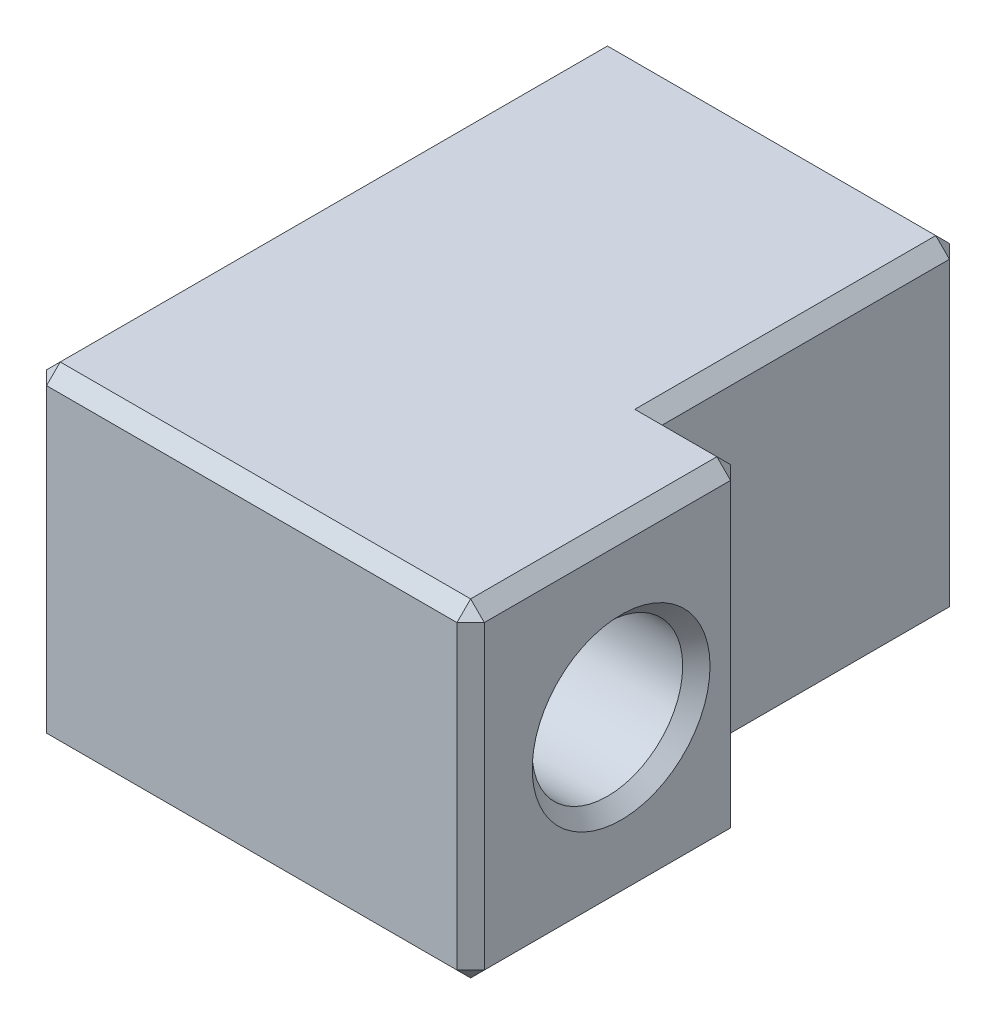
ISO-10303-21;
HEADER;
FILE_DESCRIPTION(('STEP AP214'),'2;1');
FILE_NAME('part.step','',(''),(''),'','','');
FILE_SCHEMA(('AUTOMOTIVE_DESIGN { 1 0 10303 214 1 1 1 1 }'));
ENDSEC;
DATA;
#1=APPLICATION_CONTEXT('core data for automotive mechanical design processes');
#2=APPLICATION_PROTOCOL_DEFINITION('international standard','automotive_design',2000,#1);
#3=PRODUCT_CONTEXT('',#1,'mechanical');
#4=PRODUCT('Part','Part','',(#3));
#5=PRODUCT_RELATED_PRODUCT_CATEGORY('part','',(#4));
#6=PRODUCT_DEFINITION_FORMATION('','',#4);
#7=PRODUCT_DEFINITION_CONTEXT('part definition',#1,'design');
#8=PRODUCT_DEFINITION('design','',#6,#7);
#9=PRODUCT_DEFINITION_SHAPE('','',#8);
#10=(LENGTH_UNIT() NAMED_UNIT(*) SI_UNIT(.MILLI.,.METRE.));
#11=(NAMED_UNIT(*) PLANE_ANGLE_UNIT() SI_UNIT($,.RADIAN.));
#12=(NAMED_UNIT(*) SI_UNIT($,.STERADIAN.) SOLID_ANGLE_UNIT());
#13=UNCERTAINTY_MEASURE_WITH_UNIT(LENGTH_MEASURE(1.E-05),#10,'distance_accuracy_value','');
#14=(GEOMETRIC_REPRESENTATION_CONTEXT(3) GLOBAL_UNCERTAINTY_ASSIGNED_CONTEXT((#13)) GLOBAL_UNIT_ASSIGNED_CONTEXT((#10,
#11,#12)) REPRESENTATION_CONTEXT('',''));
#15=CARTESIAN_POINT('',(0.,0.,0.));
#16=DIRECTION('',(0.,0.,1.));
#17=DIRECTION('',(1.,0.,0.));
#18=AXIS2_PLACEMENT_3D('',#15,#16,#17);
#19=CARTESIAN_POINT('',(-33.,40.,-21.));
#20=DIRECTION('',(1.,0.,0.));
#21=DIRECTION('',(0.,0.,-1.));
#22=AXIS2_PLACEMENT_3D('',#19,#20,#21);
#23=PLANE('',#22);
#24=CARTESIAN_POINT('',(-33.,34.,-5.5));
#25=DIRECTION('',(1.,0.,0.));
#26=DIRECTION('',(0.,0.,-1.));
#27=AXIS2_PLACEMENT_3D('',#24,#25,#26);
#28=CIRCLE('',#27,3.25);
#29=CARTESIAN_POINT('',(-33.,34.,-8.75));
#30=VERTEX_POINT('',#29);
#31=EDGE_CURVE('E189',#30,#30,#28,.F.);
#32=ORIENTED_EDGE('',*,*,#31,.T.);
#33=EDGE_LOOP('',(#32));
#34=FACE_BOUND('',#33,.T.);
#35=DIRECTION('',(0.,1.,0.));
#36=VECTOR('',#35,1.);
#37=CARTESIAN_POINT('',(-33.,40.,-9.5));
#38=LINE('',#37,#36);
#39=CARTESIAN_POINT('',(-33.,28.5,-9.5));
#40=VERTEX_POINT('',#39);
#41=CARTESIAN_POINT('',(-33.,39.5,-9.5));
#42=VERTEX_POINT('',#41);
#43=EDGE_CURVE('E154',#40,#42,#38,.T.);
#44=ORIENTED_EDGE('',*,*,#43,.T.);
#45=DIRECTION('',(0.,0.,1.));
#46=VECTOR('',#45,1.);
#47=CARTESIAN_POINT('',(-33.,39.5,-21.));
#48=LINE('',#47,#46);
#49=CARTESIAN_POINT('',(-33.,39.5,-0.5));
#50=VERTEX_POINT('',#49);
#51=EDGE_CURVE('E150',#42,#50,#48,.T.);
#52=ORIENTED_EDGE('',*,*,#51,.T.);
#53=DIRECTION('',(0.,-1.,0.));
#54=VECTOR('',#53,1.);
#55=CARTESIAN_POINT('',(-33.,28.,-0.5));
#56=LINE('',#55,#54);
#57=CARTESIAN_POINT('',(-33.,28.5,-0.5));
#58=VERTEX_POINT('',#57);
#59=EDGE_CURVE('E143',#50,#58,#56,.T.);
#60=ORIENTED_EDGE('',*,*,#59,.T.);
#61=DIRECTION('',(0.,0.,-1.));
#62=VECTOR('',#61,1.);
#63=CARTESIAN_POINT('',(-33.,28.5,-21.));
#64=LINE('',#63,#62);
#65=EDGE_CURVE('E147',#58,#40,#64,.T.);
#66=ORIENTED_EDGE('',*,*,#65,.T.);
#67=EDGE_LOOP('',(#44,#52,#60,#66));
#68=FACE_BOUND('',#67,.T.);
#69=ADVANCED_FACE('F16',(#34,#68),#23,.T.);
#70=CARTESIAN_POINT('',(-33.,28.,-21.));
#71=DIRECTION('',(0.,-1.,0.));
#72=DIRECTION('',(1.,0.,0.));
#73=AXIS2_PLACEMENT_3D('',#70,#71,#72);
#74=PLANE('',#73);
#75=DIRECTION('',(1.,0.,0.));
#76=VECTOR('',#75,1.);
#77=CARTESIAN_POINT('',(-33.,28.,-20.5));
#78=LINE('',#77,#76);
#79=CARTESIAN_POINT('',(-48.5,28.,-20.5));
#80=VERTEX_POINT('',#79);
#81=CARTESIAN_POINT('',(-36.5,28.,-20.5));
#82=VERTEX_POINT('',#81);
#83=EDGE_CURVE('E541',#80,#82,#78,.T.);
#84=ORIENTED_EDGE('',*,*,#83,.T.);
#85=DIRECTION('',(0.,0.,1.));
#86=VECTOR('',#85,1.);
#87=CARTESIAN_POINT('',(-36.5,28.,-10.));
#88=LINE('',#87,#86);
#89=CARTESIAN_POINT('',(-36.5,28.,-9.5));
#90=VERTEX_POINT('',#89);
#91=EDGE_CURVE('E485',#82,#90,#88,.T.);
#92=ORIENTED_EDGE('',*,*,#91,.T.);
#93=DIRECTION('',(1.,0.,0.));
#94=VECTOR('',#93,1.);
#95=CARTESIAN_POINT('',(-33.,28.,-9.5));
#96=LINE('',#95,#94);
#97=CARTESIAN_POINT('',(-33.5,28.,-9.5));
#98=VERTEX_POINT('',#97);
#99=EDGE_CURVE('E534',#90,#98,#96,.T.);
#100=ORIENTED_EDGE('',*,*,#99,.T.);
#101=DIRECTION('',(0.,0.,1.));
#102=VECTOR('',#101,1.);
#103=CARTESIAN_POINT('',(-33.5,28.,-21.));
#104=LINE('',#103,#102);
#105=CARTESIAN_POINT('',(-33.5,28.,-0.5));
#106=VERTEX_POINT('',#105);
#107=EDGE_CURVE('E536',#98,#106,#104,.T.);
#108=ORIENTED_EDGE('',*,*,#107,.T.);
#109=DIRECTION('',(-1.,0.,0.));
#110=VECTOR('',#109,1.);
#111=CARTESIAN_POINT('',(-49.,28.,-0.5));
#112=LINE('',#111,#110);
#113=CARTESIAN_POINT('',(-48.5,28.,-0.5));
#114=VERTEX_POINT('',#113);
#115=EDGE_CURVE('E464',#106,#114,#112,.T.);
#116=ORIENTED_EDGE('',*,*,#115,.T.);
#117=DIRECTION('',(0.,0.,-1.));
#118=VECTOR('',#117,1.);
#119=CARTESIAN_POINT('',(-48.5,28.,-21.));
#120=LINE('',#119,#118);
#121=EDGE_CURVE('E539',#114,#80,#120,.T.);
#122=ORIENTED_EDGE('',*,*,#121,.T.);
#123=EDGE_LOOP('',(#84,#92,#100,#108,#116,#122));
#124=FACE_BOUND('',#123,.T.);
#125=ADVANCED_FACE('F273',(#124),#74,.T.);
#126=CARTESIAN_POINT('',(-49.,40.,-21.));
#127=DIRECTION('',(-1.,0.,0.));
#128=DIRECTION('',(0.,-1.,0.));
#129=AXIS2_PLACEMENT_3D('',#126,#127,#128);
#130=PLANE('',#129);
#131=DIRECTION('',(0.,0.,1.));
#132=VECTOR('',#131,1.);
#133=CARTESIAN_POINT('',(-49.,28.5,-21.));
#134=LINE('',#133,#132);
#135=CARTESIAN_POINT('',(-49.,28.5,-20.5));
#136=VERTEX_POINT('',#135);
#137=CARTESIAN_POINT('',(-49.,28.5,-0.5));
#138=VERTEX_POINT('',#137);
#139=EDGE_CURVE('E212',#136,#138,#134,.T.);
#140=ORIENTED_EDGE('',*,*,#139,.T.);
#141=DIRECTION('',(0.,1.,0.));
#142=VECTOR('',#141,1.);
#143=CARTESIAN_POINT('',(-49.,40.,-0.5));
#144=LINE('',#143,#142);
#145=CARTESIAN_POINT('',(-49.,33.4993753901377,-0.499999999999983));
#146=VERTEX_POINT('',#145);
#147=EDGE_CURVE('E218',#138,#146,#144,.T.);
#148=ORIENTED_EDGE('',*,*,#147,.T.);
#149=CARTESIAN_POINT('',(-49.,34.,-5.5));
#150=DIRECTION('',(-1.,0.,0.));
#151=DIRECTION('',(0.,0.,1.));
#152=AXIS2_PLACEMENT_3D('',#149,#150,#151);
#153=CIRCLE('',#152,5.025);
#154=CARTESIAN_POINT('',(-49.,34.5006246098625,-0.5));
#155=VERTEX_POINT('',#154);
#156=EDGE_CURVE('E413',#155,#146,#153,.T.);
#157=ORIENTED_EDGE('',*,*,#156,.F.);
#158=DIRECTION('',(0.,1.,0.));
#159=VECTOR('',#158,1.);
#160=CARTESIAN_POINT('',(-49.,40.,-0.5));
#161=LINE('',#160,#159);
#162=CARTESIAN_POINT('',(-49.,39.5,-0.5));
#163=VERTEX_POINT('',#162);
#164=EDGE_CURVE('E216',#155,#163,#161,.T.);
#165=ORIENTED_EDGE('',*,*,#164,.T.);
#166=DIRECTION('',(0.,0.,-1.));
#167=VECTOR('',#166,1.);
#168=CARTESIAN_POINT('',(-49.,39.5,-21.));
#169=LINE('',#168,#167);
#170=CARTESIAN_POINT('',(-49.,39.5,-20.5));
#171=VERTEX_POINT('',#170);
#172=EDGE_CURVE('E214',#163,#171,#169,.T.);
#173=ORIENTED_EDGE('',*,*,#172,.T.);
#174=DIRECTION('',(0.,-1.,0.));
#175=VECTOR('',#174,1.);
#176=CARTESIAN_POINT('',(-49.,40.,-20.5));
#177=LINE('',#176,#175);
#178=EDGE_CURVE('E210',#171,#136,#177,.T.);
#179=ORIENTED_EDGE('',*,*,#178,.T.);
#180=EDGE_LOOP('',(#140,#148,#157,#165,#173,#179));
#181=FACE_BOUND('',#180,.T.);
#182=ADVANCED_FACE('F276',(#181),#130,.T.);
#183=CARTESIAN_POINT('',(-33.,40.,-21.));
#184=DIRECTION('',(0.,1.,0.));
#185=DIRECTION('',(0.,0.,1.));
#186=AXIS2_PLACEMENT_3D('',#183,#184,#185);
#187=PLANE('',#186);
#188=DIRECTION('',(1.,0.,0.));
#189=VECTOR('',#188,1.);
#190=CARTESIAN_POINT('',(-33.,40.,-0.5));
#191=LINE('',#190,#189);
#192=CARTESIAN_POINT('',(-48.5,40.,-0.5));
#193=VERTEX_POINT('',#192);
#194=CARTESIAN_POINT('',(-33.5,40.,-0.5));
#195=VERTEX_POINT('',#194);
#196=EDGE_CURVE('E548',#193,#195,#191,.T.);
#197=ORIENTED_EDGE('',*,*,#196,.T.);
#198=DIRECTION('',(0.,0.,-1.));
#199=VECTOR('',#198,1.);
#200=CARTESIAN_POINT('',(-33.5,40.,-21.));
#201=LINE('',#200,#199);
#202=CARTESIAN_POINT('',(-33.5,40.,-9.5));
#203=VERTEX_POINT('',#202);
#204=EDGE_CURVE('E510',#195,#203,#201,.T.);
#205=ORIENTED_EDGE('',*,*,#204,.T.);
#206=DIRECTION('',(-1.,0.,0.));
#207=VECTOR('',#206,1.);
#208=CARTESIAN_POINT('',(-36.,40.,-9.5));
#209=LINE('',#208,#207);
#210=CARTESIAN_POINT('',(-36.5,40.,-9.5));
#211=VERTEX_POINT('',#210);
#212=EDGE_CURVE('E551',#203,#211,#209,.T.);
#213=ORIENTED_EDGE('',*,*,#212,.T.);
#214=DIRECTION('',(0.,0.,-1.));
#215=VECTOR('',#214,1.);
#216=CARTESIAN_POINT('',(-36.5,40.,-21.));
#217=LINE('',#216,#215);
#218=CARTESIAN_POINT('',(-36.5,40.,-20.5));
#219=VERTEX_POINT('',#218);
#220=EDGE_CURVE('E495',#211,#219,#217,.T.);
#221=ORIENTED_EDGE('',*,*,#220,.T.);
#222=DIRECTION('',(-1.,0.,0.));
#223=VECTOR('',#222,1.);
#224=CARTESIAN_POINT('',(-33.,40.,-20.5));
#225=LINE('',#224,#223);
#226=CARTESIAN_POINT('',(-48.5,40.,-20.5));
#227=VERTEX_POINT('',#226);
#228=EDGE_CURVE('E229',#219,#227,#225,.T.);
#229=ORIENTED_EDGE('',*,*,#228,.T.);
#230=DIRECTION('',(0.,0.,1.));
#231=VECTOR('',#230,1.);
#232=CARTESIAN_POINT('',(-48.5,40.,-21.));
#233=LINE('',#232,#231);
#234=EDGE_CURVE('E388',#227,#193,#233,.T.);
#235=ORIENTED_EDGE('',*,*,#234,.T.);
#236=EDGE_LOOP('',(#197,#205,#213,#221,#229,#235));
#237=FACE_BOUND('',#236,.T.);
#238=ADVANCED_FACE('F269',(#237),#187,.T.);
#239=CARTESIAN_POINT('',(0.,0.,-21.));
#240=DIRECTION('',(0.,0.,-1.));
#241=DIRECTION('',(-1.,0.,0.));
#242=AXIS2_PLACEMENT_3D('',#239,#240,#241);
#243=PLANE('',#242);
#244=DIRECTION('',(0.,1.,0.));
#245=VECTOR('',#244,1.);
#246=CARTESIAN_POINT('',(-48.5,0.,-21.));
#247=LINE('',#246,#245);
#248=CARTESIAN_POINT('',(-48.5,28.5,-21.));
#249=VERTEX_POINT('',#248);
#250=CARTESIAN_POINT('',(-48.5,39.5,-21.));
#251=VERTEX_POINT('',#250);
#252=EDGE_CURVE('E531',#249,#251,#247,.T.);
#253=ORIENTED_EDGE('',*,*,#252,.T.);
#254=DIRECTION('',(1.,0.,0.));
#255=VECTOR('',#254,1.);
#256=CARTESIAN_POINT('',(0.,39.5,-21.));
#257=LINE('',#256,#255);
#258=CARTESIAN_POINT('',(-36.5,39.5,-21.));
#259=VERTEX_POINT('',#258);
#260=EDGE_CURVE('E11',#251,#259,#257,.T.);
#261=ORIENTED_EDGE('',*,*,#260,.T.);
#262=DIRECTION('',(0.,-1.,0.));
#263=VECTOR('',#262,1.);
#264=CARTESIAN_POINT('',(-36.5,28.,-21.));
#265=LINE('',#264,#263);
#266=CARTESIAN_POINT('',(-36.5,28.5,-21.));
#267=VERTEX_POINT('',#266);
#268=EDGE_CURVE('E25',#259,#267,#265,.T.);
#269=ORIENTED_EDGE('',*,*,#268,.T.);
#270=DIRECTION('',(-1.,0.,0.));
#271=VECTOR('',#270,1.);
#272=CARTESIAN_POINT('',(0.,28.5,-21.));
#273=LINE('',#272,#271);
#274=EDGE_CURVE('E529',#267,#249,#273,.T.);
#275=ORIENTED_EDGE('',*,*,#274,.T.);
#276=EDGE_LOOP('',(#253,#261,#269,#275));
#277=FACE_BOUND('',#276,.T.);
#278=ADVANCED_FACE('F266',(#277),#243,.T.);
#279=CARTESIAN_POINT('',(0.,0.,0.));
#280=DIRECTION('',(0.,0.,-1.));
#281=DIRECTION('',(-1.,0.,0.));
#282=AXIS2_PLACEMENT_3D('',#279,#280,#281);
#283=PLANE('',#282);
#284=DIRECTION('',(0.,1.,0.));
#285=VECTOR('',#284,1.);
#286=CARTESIAN_POINT('',(-33.5,40.,0.));
#287=LINE('',#286,#285);
#288=CARTESIAN_POINT('',(-33.5,28.5,0.));
#289=VERTEX_POINT('',#288);
#290=CARTESIAN_POINT('',(-33.5,39.5,0.));
#291=VERTEX_POINT('',#290);
#292=EDGE_CURVE('E161',#289,#291,#287,.T.);
#293=ORIENTED_EDGE('',*,*,#292,.T.);
#294=DIRECTION('',(-1.,0.,0.));
#295=VECTOR('',#294,1.);
#296=CARTESIAN_POINT('',(-49.,39.5,0.));
#297=LINE('',#296,#295);
#298=CARTESIAN_POINT('',(-48.5,39.5,0.));
#299=VERTEX_POINT('',#298);
#300=EDGE_CURVE('E208',#291,#299,#297,.T.);
#301=ORIENTED_EDGE('',*,*,#300,.T.);
#302=DIRECTION('',(0.,-1.,0.));
#303=VECTOR('',#302,1.);
#304=CARTESIAN_POINT('',(-48.5,28.,0.));
#305=LINE('',#304,#303);
#306=CARTESIAN_POINT('',(-48.5,28.5,0.));
#307=VERTEX_POINT('',#306);
#308=EDGE_CURVE('E205',#299,#307,#305,.T.);
#309=ORIENTED_EDGE('',*,*,#308,.T.);
#310=DIRECTION('',(1.,0.,0.));
#311=VECTOR('',#310,1.);
#312=CARTESIAN_POINT('',(-33.,28.5,0.));
#313=LINE('',#312,#311);
#314=EDGE_CURVE('E202',#307,#289,#313,.T.);
#315=ORIENTED_EDGE('',*,*,#314,.T.);
#316=EDGE_LOOP('',(#293,#301,#309,#315));
#317=FACE_BOUND('',#316,.T.);
#318=ADVANCED_FACE('F261',(#317),#283,.F.);
#319=CARTESIAN_POINT('',(-33.,28.,-10.));
#320=DIRECTION('',(0.,0.,1.));
#321=DIRECTION('',(1.,0.,0.));
#322=AXIS2_PLACEMENT_3D('',#319,#320,#321);
#323=PLANE('',#322);
#324=DIRECTION('',(0.,1.,0.));
#325=VECTOR('',#324,1.);
#326=CARTESIAN_POINT('',(-36.,28.,-10.));
#327=LINE('',#326,#325);
#328=CARTESIAN_POINT('',(-36.,28.5,-10.));
#329=VERTEX_POINT('',#328);
#330=CARTESIAN_POINT('',(-36.,39.5,-10.));
#331=VERTEX_POINT('',#330);
#332=EDGE_CURVE('E180',#329,#331,#327,.T.);
#333=ORIENTED_EDGE('',*,*,#332,.T.);
#334=DIRECTION('',(1.,0.,0.));
#335=VECTOR('',#334,1.);
#336=CARTESIAN_POINT('',(-33.,39.5,-10.));
#337=LINE('',#336,#335);
#338=CARTESIAN_POINT('',(-33.5,39.5,-10.));
#339=VERTEX_POINT('',#338);
#340=EDGE_CURVE('E200',#331,#339,#337,.T.);
#341=ORIENTED_EDGE('',*,*,#340,.T.);
#342=DIRECTION('',(0.,-1.,0.));
#343=VECTOR('',#342,1.);
#344=CARTESIAN_POINT('',(-33.5,28.,-10.));
#345=LINE('',#344,#343);
#346=CARTESIAN_POINT('',(-33.5,28.5,-10.));
#347=VERTEX_POINT('',#346);
#348=EDGE_CURVE('E197',#339,#347,#345,.T.);
#349=ORIENTED_EDGE('',*,*,#348,.T.);
#350=DIRECTION('',(-1.,0.,0.));
#351=VECTOR('',#350,1.);
#352=CARTESIAN_POINT('',(-36.,28.5,-10.));
#353=LINE('',#352,#351);
#354=EDGE_CURVE('E195',#347,#329,#353,.T.);
#355=ORIENTED_EDGE('',*,*,#354,.T.);
#356=EDGE_LOOP('',(#333,#341,#349,#355));
#357=FACE_BOUND('',#356,.T.);
#358=ADVANCED_FACE('F258',(#357),#323,.F.);
#359=CARTESIAN_POINT('',(-36.,28.,-21.));
#360=DIRECTION('',(-1.,0.,0.));
#361=DIRECTION('',(0.,0.,1.));
#362=AXIS2_PLACEMENT_3D('',#359,#360,#361);
#363=PLANE('',#362);
#364=DIRECTION('',(0.,1.,0.));
#365=VECTOR('',#364,1.);
#366=CARTESIAN_POINT('',(-36.,40.,-20.5));
#367=LINE('',#366,#365);
#368=CARTESIAN_POINT('',(-36.,28.5,-20.5));
#369=VERTEX_POINT('',#368);
#370=CARTESIAN_POINT('',(-36.,39.5,-20.5));
#371=VERTEX_POINT('',#370);
#372=EDGE_CURVE('E545',#369,#371,#367,.T.);
#373=ORIENTED_EDGE('',*,*,#372,.T.);
#374=DIRECTION('',(0.,0.,1.));
#375=VECTOR('',#374,1.);
#376=CARTESIAN_POINT('',(-36.,39.5,-10.));
#377=LINE('',#376,#375);
#378=EDGE_CURVE('E497',#371,#331,#377,.T.);
#379=ORIENTED_EDGE('',*,*,#378,.T.);
#380=ORIENTED_EDGE('',*,*,#332,.F.);
#381=DIRECTION('',(0.,0.,-1.));
#382=VECTOR('',#381,1.);
#383=CARTESIAN_POINT('',(-36.,28.5,-21.));
#384=LINE('',#383,#382);
#385=EDGE_CURVE('E482',#329,#369,#384,.T.);
#386=ORIENTED_EDGE('',*,*,#385,.T.);
#387=EDGE_LOOP('',(#373,#379,#380,#386));
#388=FACE_BOUND('',#387,.T.);
#389=ADVANCED_FACE('F256',(#388),#363,.F.);
#390=CARTESIAN_POINT('',(-49.,34.,-5.5));
#391=DIRECTION('',(-1.,0.,0.));
#392=DIRECTION('',(0.,0.,1.));
#393=AXIS2_PLACEMENT_3D('',#390,#391,#392);
#394=CYLINDRICAL_SURFACE('',#393,2.75);
#395=CARTESIAN_POINT('',(-33.5,34.,-5.5));
#396=DIRECTION('',(1.,0.,0.));
#397=DIRECTION('',(0.,0.,-1.));
#398=AXIS2_PLACEMENT_3D('',#395,#396,#397);
#399=CIRCLE('',#398,2.75);
#400=CARTESIAN_POINT('',(-33.5,34.,-8.25));
#401=VERTEX_POINT('',#400);
#402=EDGE_CURVE('E192',#401,#401,#399,.T.);
#403=ORIENTED_EDGE('',*,*,#402,.T.);
#404=EDGE_LOOP('',(#403));
#405=FACE_BOUND('',#404,.T.);
#406=CARTESIAN_POINT('',(-43.275,34.,-5.5));
#407=DIRECTION('',(-1.,0.,0.));
#408=DIRECTION('',(0.,0.,1.));
#409=AXIS2_PLACEMENT_3D('',#406,#407,#408);
#410=CIRCLE('',#409,2.75);
#411=CARTESIAN_POINT('',(-43.275,34.,-2.75));
#412=VERTEX_POINT('',#411);
#413=EDGE_CURVE('E183',#412,#412,#410,.T.);
#414=ORIENTED_EDGE('',*,*,#413,.T.);
#415=EDGE_LOOP('',(#414));
#416=FACE_BOUND('',#415,.T.);
#417=ADVANCED_FACE('F252',(#405,#416),#394,.F.);
#418=CARTESIAN_POINT('',(-43.3,34.,-5.5));
#419=DIRECTION('',(-1.,0.,0.));
#420=DIRECTION('',(0.,0.,1.));
#421=AXIS2_PLACEMENT_3D('',#418,#419,#420);
#422=CONICAL_SURFACE('',#421,2.775,0.785398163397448);
#423=ORIENTED_EDGE('',*,*,#413,.F.);
#424=EDGE_LOOP('',(#423));
#425=FACE_BOUND('',#424,.T.);
#426=CARTESIAN_POINT('',(-43.3,34.,-5.5));
#427=DIRECTION('',(-1.,0.,0.));
#428=DIRECTION('',(0.,0.,1.));
#429=AXIS2_PLACEMENT_3D('',#426,#427,#428);
#430=CIRCLE('',#429,2.775);
#431=CARTESIAN_POINT('',(-43.3,34.,-2.725));
#432=VERTEX_POINT('',#431);
#433=EDGE_CURVE('E427',#432,#432,#430,.T.);
#434=ORIENTED_EDGE('',*,*,#433,.T.);
#435=EDGE_LOOP('',(#434));
#436=FACE_BOUND('',#435,.T.);
#437=ADVANCED_FACE('F248',(#425,#436),#422,.F.);
#438=CARTESIAN_POINT('',(-43.3,36.775,-5.5));
#439=DIRECTION('',(1.,0.,0.));
#440=DIRECTION('',(0.,0.,-1.));
#441=AXIS2_PLACEMENT_3D('',#438,#439,#440);
#442=PLANE('',#441);
#443=ORIENTED_EDGE('',*,*,#433,.F.);
#444=EDGE_LOOP('',(#443));
#445=FACE_BOUND('',#444,.T.);
#446=CARTESIAN_POINT('',(-43.3,34.,-5.5));
#447=DIRECTION('',(-1.,0.,0.));
#448=DIRECTION('',(0.,0.,1.));
#449=AXIS2_PLACEMENT_3D('',#446,#447,#448);
#450=CIRCLE('',#449,5.);
#451=CARTESIAN_POINT('',(-43.3,34.,-0.5));
#452=VERTEX_POINT('',#451);
#453=EDGE_CURVE('E422',#452,#452,#450,.T.);
#454=ORIENTED_EDGE('',*,*,#453,.T.);
#455=EDGE_LOOP('',(#454));
#456=FACE_BOUND('',#455,.T.);
#457=ADVANCED_FACE('F244',(#445,#456),#442,.F.);
#458=CARTESIAN_POINT('',(-49.,34.,-5.5));
#459=DIRECTION('',(-1.,0.,0.));
#460=DIRECTION('',(0.,0.,1.));
#461=AXIS2_PLACEMENT_3D('',#458,#459,#460);
#462=CYLINDRICAL_SURFACE('',#461,5.);
#463=ORIENTED_EDGE('',*,*,#453,.F.);
#464=EDGE_LOOP('',(#463));
#465=FACE_BOUND('',#464,.T.);
#466=CARTESIAN_POINT('',(-48.975,34.,-5.5));
#467=DIRECTION('',(-1.,0.,0.));
#468=DIRECTION('',(0.,0.,1.));
#469=AXIS2_PLACEMENT_3D('',#466,#467,#468);
#470=CIRCLE('',#469,5.);
#471=CARTESIAN_POINT('',(-48.975,34.,-0.5));
#472=VERTEX_POINT('',#471);
#473=EDGE_CURVE('E417',#472,#472,#470,.T.);
#474=ORIENTED_EDGE('',*,*,#473,.T.);
#475=EDGE_LOOP('',(#474));
#476=FACE_BOUND('',#475,.T.);
#477=ADVANCED_FACE('F240',(#465,#476),#462,.F.);
#478=CARTESIAN_POINT('',(-49.,34.,-5.5));
#479=DIRECTION('',(-1.,0.,0.));
#480=DIRECTION('',(0.,0.,1.));
#481=AXIS2_PLACEMENT_3D('',#478,#479,#480);
#482=CONICAL_SURFACE('',#481,5.025,0.785398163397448);
#483=ORIENTED_EDGE('',*,*,#473,.F.);
#484=EDGE_LOOP('',(#483));
#485=FACE_BOUND('',#484,.T.);
#486=ORIENTED_EDGE('',*,*,#156,.T.);
#487=CARTESIAN_POINT('',(-49.,33.4993753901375,-0.5));
#488=CARTESIAN_POINT('',(-48.9916666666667,33.6662502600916,-0.491666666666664));
#489=CARTESIAN_POINT('',(-48.9875,33.8331251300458,-0.487499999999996));
#490=CARTESIAN_POINT('',(-48.9875,34.1668748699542,-0.487499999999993));
#491=CARTESIAN_POINT('',(-48.9916666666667,34.3337497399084,-0.491666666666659));
#492=CARTESIAN_POINT('',(-49.,34.5006246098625,-0.499999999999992));
#493=B_SPLINE_CURVE_WITH_KNOTS('',3,(#487,#488,#489,#490,#491,#492),.UNSPECIFIED.,.F.,.F.,(4,2,
4),(0.,0.500936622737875,1.00187324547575),.UNSPECIFIED.);
#494=EDGE_CURVE('E221',#146,#155,#493,.T.);
#495=ORIENTED_EDGE('',*,*,#494,.T.);
#496=EDGE_LOOP('',(#486,#495));
#497=FACE_BOUND('',#496,.T.);
#498=ADVANCED_FACE('F235',(#485,#497),#482,.F.);
#499=CARTESIAN_POINT('',(-33.,34.,-5.5));
#500=DIRECTION('',(1.,0.,0.));
#501=DIRECTION('',(0.,0.,-1.));
#502=AXIS2_PLACEMENT_3D('',#499,#500,#501);
#503=CONICAL_SURFACE('',#502,3.25,0.785398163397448);
#504=ORIENTED_EDGE('',*,*,#402,.F.);
#505=EDGE_LOOP('',(#504));
#506=FACE_BOUND('',#505,.T.);
#507=ORIENTED_EDGE('',*,*,#31,.F.);
#508=EDGE_LOOP('',(#507));
#509=FACE_BOUND('',#508,.T.);
#510=ADVANCED_FACE('F239',(#506,#509),#503,.F.);
#511=CARTESIAN_POINT('',(-49.,40.,-20.5));
#512=DIRECTION('',(0.707106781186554,0.,0.707106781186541));
#513=DIRECTION('',(0.,-1.,0.));
#514=AXIS2_PLACEMENT_3D('',#511,#512,#513);
#515=PLANE('',#514);
#516=DIRECTION('',(-0.707106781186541,0.,0.707106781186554));
#517=VECTOR('',#516,1.);
#518=CARTESIAN_POINT('',(-48.75,28.5,-20.75));
#519=LINE('',#518,#517);
#520=EDGE_CURVE('E20',#136,#249,#519,.F.);
#521=ORIENTED_EDGE('',*,*,#520,.F.);
#522=ORIENTED_EDGE('',*,*,#178,.F.);
#523=DIRECTION('',(0.707106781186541,0.,-0.707106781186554));
#524=VECTOR('',#523,1.);
#525=CARTESIAN_POINT('',(-49.,39.5,-20.5));
#526=LINE('',#525,#524);
#527=EDGE_CURVE('E392',#251,#171,#526,.F.);
#528=ORIENTED_EDGE('',*,*,#527,.F.);
#529=ORIENTED_EDGE('',*,*,#252,.F.);
#530=EDGE_LOOP('',(#521,#522,#528,#529));
#531=FACE_BOUND('',#530,.T.);
#532=ADVANCED_FACE('F18',(#531),#515,.F.);
#533=CARTESIAN_POINT('',(-48.5,28.,-20.5));
#534=DIRECTION('',(-0.577350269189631,-0.577350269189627,-0.577350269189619));
#535=DIRECTION('',(0.707106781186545,-0.70710678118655,0.));
#536=AXIS2_PLACEMENT_3D('',#533,#534,#535);
#537=PLANE('',#536);
#538=DIRECTION('',(0.,0.707106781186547,-0.707106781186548));
#539=VECTOR('',#538,1.);
#540=CARTESIAN_POINT('',(-48.5,28.,-20.5));
#541=LINE('',#540,#539);
#542=EDGE_CURVE('E400',#80,#249,#541,.T.);
#543=ORIENTED_EDGE('',*,*,#542,.F.);
#544=DIRECTION('',(0.707106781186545,-0.70710678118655,0.));
#545=VECTOR('',#544,1.);
#546=CARTESIAN_POINT('',(-48.5,28.,-20.5));
#547=LINE('',#546,#545);
#548=EDGE_CURVE('E391',#136,#80,#547,.T.);
#549=ORIENTED_EDGE('',*,*,#548,.F.);
#550=ORIENTED_EDGE('',*,*,#520,.T.);
#551=EDGE_LOOP('',(#543,#549,#550));
#552=FACE_BOUND('',#551,.T.);
#553=ADVANCED_FACE('F552',(#552),#537,.T.);
#554=CARTESIAN_POINT('',(-49.,28.5,-21.));
#555=DIRECTION('',(0.70710678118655,0.707106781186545,0.));
#556=DIRECTION('',(0.,0.,1.));
#557=AXIS2_PLACEMENT_3D('',#554,#555,#556);
#558=PLANE('',#557);
#559=ORIENTED_EDGE('',*,*,#548,.T.);
#560=ORIENTED_EDGE('',*,*,#121,.F.);
#561=DIRECTION('',(-0.707106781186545,0.70710678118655,0.));
#562=VECTOR('',#561,1.);
#563=CARTESIAN_POINT('',(-48.75,28.25,-0.5));
#564=LINE('',#563,#562);
#565=EDGE_CURVE('E403',#138,#114,#564,.F.);
#566=ORIENTED_EDGE('',*,*,#565,.F.);
#567=ORIENTED_EDGE('',*,*,#139,.F.);
#568=EDGE_LOOP('',(#559,#560,#566,#567));
#569=FACE_BOUND('',#568,.T.);
#570=ADVANCED_FACE('F378',(#569),#558,.F.);
#571=CARTESIAN_POINT('',(-48.5,0.,0.));
#572=DIRECTION('',(-0.707106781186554,0.,0.707106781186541));
#573=DIRECTION('',(0.,1.,0.));
#574=AXIS2_PLACEMENT_3D('',#571,#572,#573);
#575=PLANE('',#574);
#576=ORIENTED_EDGE('',*,*,#494,.F.);
#577=ORIENTED_EDGE('',*,*,#147,.F.);
#578=DIRECTION('',(-0.707106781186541,0.,-0.707106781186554));
#579=VECTOR('',#578,1.);
#580=CARTESIAN_POINT('',(-48.5,28.5,0.));
#581=LINE('',#580,#579);
#582=EDGE_CURVE('E447',#307,#138,#581,.T.);
#583=ORIENTED_EDGE('',*,*,#582,.F.);
#584=ORIENTED_EDGE('',*,*,#308,.F.);
#585=DIRECTION('',(0.707106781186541,0.,0.707106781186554));
#586=VECTOR('',#585,1.);
#587=CARTESIAN_POINT('',(-49.,39.5,-0.5));
#588=LINE('',#587,#586);
#589=EDGE_CURVE('E442',#163,#299,#588,.T.);
#590=ORIENTED_EDGE('',*,*,#589,.F.);
#591=ORIENTED_EDGE('',*,*,#164,.F.);
#592=EDGE_LOOP('',(#576,#577,#583,#584,#590,#591));
#593=FACE_BOUND('',#592,.T.);
#594=ADVANCED_FACE('F231',(#593),#575,.T.);
#595=CARTESIAN_POINT('',(-48.5,40.,-21.));
#596=DIRECTION('',(0.707106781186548,-0.707106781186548,0.));
#597=DIRECTION('',(0.,0.,1.));
#598=AXIS2_PLACEMENT_3D('',#595,#596,#597);
#599=PLANE('',#598);
#600=DIRECTION('',(-0.707106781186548,-0.707106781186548,0.));
#601=VECTOR('',#600,1.);
#602=CARTESIAN_POINT('',(-49.,39.5,-20.5));
#603=LINE('',#602,#601);
#604=EDGE_CURVE('E384',#171,#227,#603,.F.);
#605=ORIENTED_EDGE('',*,*,#604,.F.);
#606=ORIENTED_EDGE('',*,*,#172,.F.);
#607=DIRECTION('',(0.707106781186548,0.707106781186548,0.));
#608=VECTOR('',#607,1.);
#609=CARTESIAN_POINT('',(-49.,39.5,-0.5));
#610=LINE('',#609,#608);
#611=EDGE_CURVE('E448',#193,#163,#610,.F.);
#612=ORIENTED_EDGE('',*,*,#611,.F.);
#613=ORIENTED_EDGE('',*,*,#234,.F.);
#614=EDGE_LOOP('',(#605,#606,#612,#613));
#615=FACE_BOUND('',#614,.T.);
#616=ADVANCED_FACE('F369',(#615),#599,.F.);
#617=CARTESIAN_POINT('',(-49.,39.5,-20.5));
#618=DIRECTION('',(-0.577350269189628,0.577350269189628,-0.57735026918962));
#619=DIRECTION('',(-0.707106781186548,-0.707106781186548,0.));
#620=AXIS2_PLACEMENT_3D('',#617,#618,#619);
#621=PLANE('',#620);
#622=ORIENTED_EDGE('',*,*,#527,.T.);
#623=ORIENTED_EDGE('',*,*,#604,.T.);
#624=DIRECTION('',(0.,0.707106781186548,0.707106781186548));
#625=VECTOR('',#624,1.);
#626=CARTESIAN_POINT('',(-48.5,39.75,-20.75));
#627=LINE('',#626,#625);
#628=EDGE_CURVE('E395',#251,#227,#627,.T.);
#629=ORIENTED_EDGE('',*,*,#628,.F.);
#630=EDGE_LOOP('',(#622,#623,#629));
#631=FACE_BOUND('',#630,.T.);
#632=ADVANCED_FACE('F366',(#631),#621,.T.);
#633=CARTESIAN_POINT('',(-33.,28.,-20.5));
#634=DIRECTION('',(0.,0.707106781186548,0.707106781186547));
#635=DIRECTION('',(1.,0.,0.));
#636=AXIS2_PLACEMENT_3D('',#633,#634,#635);
#637=PLANE('',#636);
#638=ORIENTED_EDGE('',*,*,#542,.T.);
#639=ORIENTED_EDGE('',*,*,#274,.F.);
#640=DIRECTION('',(0.,-0.707106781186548,0.707106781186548));
#641=VECTOR('',#640,1.);
#642=CARTESIAN_POINT('',(-36.5,28.25,-20.75));
#643=LINE('',#642,#641);
#644=EDGE_CURVE('E465',#82,#267,#643,.F.);
#645=ORIENTED_EDGE('',*,*,#644,.F.);
#646=ORIENTED_EDGE('',*,*,#83,.F.);
#647=EDGE_LOOP('',(#638,#639,#645,#646));
#648=FACE_BOUND('',#647,.T.);
#649=ADVANCED_FACE('F362',(#648),#637,.F.);
#650=CARTESIAN_POINT('',(-48.5,28.5,0.));
#651=DIRECTION('',(-0.577350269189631,-0.577350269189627,0.577350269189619));
#652=DIRECTION('',(0.707106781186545,-0.70710678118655,0.));
#653=AXIS2_PLACEMENT_3D('',#650,#651,#652);
#654=PLANE('',#653);
#655=ORIENTED_EDGE('',*,*,#582,.T.);
#656=ORIENTED_EDGE('',*,*,#565,.T.);
#657=DIRECTION('',(0.,0.707106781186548,0.707106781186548));
#658=VECTOR('',#657,1.);
#659=CARTESIAN_POINT('',(-48.5,28.5,0.));
#660=LINE('',#659,#658);
#661=EDGE_CURVE('E462',#307,#114,#660,.F.);
#662=ORIENTED_EDGE('',*,*,#661,.F.);
#663=EDGE_LOOP('',(#655,#656,#662));
#664=FACE_BOUND('',#663,.T.);
#665=ADVANCED_FACE('F358',(#664),#654,.T.);
#666=CARTESIAN_POINT('',(-49.,39.5,-0.5));
#667=DIRECTION('',(-0.577350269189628,0.577350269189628,0.57735026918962));
#668=DIRECTION('',(-0.707106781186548,-0.707106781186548,0.));
#669=AXIS2_PLACEMENT_3D('',#666,#667,#668);
#670=PLANE('',#669);
#671=ORIENTED_EDGE('',*,*,#611,.T.);
#672=ORIENTED_EDGE('',*,*,#589,.T.);
#673=DIRECTION('',(0.,0.707106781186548,-0.707106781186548));
#674=VECTOR('',#673,1.);
#675=CARTESIAN_POINT('',(-48.5,39.75,-0.249999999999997));
#676=LINE('',#675,#674);
#677=EDGE_CURVE('E450',#193,#299,#676,.F.);
#678=ORIENTED_EDGE('',*,*,#677,.F.);
#679=EDGE_LOOP('',(#671,#672,#678));
#680=FACE_BOUND('',#679,.T.);
#681=ADVANCED_FACE('F354',(#680),#670,.T.);
#682=CARTESIAN_POINT('',(-33.,40.,-20.5));
#683=DIRECTION('',(0.,-0.707106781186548,0.707106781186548));
#684=DIRECTION('',(-1.,0.,0.));
#685=AXIS2_PLACEMENT_3D('',#682,#683,#684);
#686=PLANE('',#685);
#687=ORIENTED_EDGE('',*,*,#628,.T.);
#688=ORIENTED_EDGE('',*,*,#228,.F.);
#689=DIRECTION('',(0.,-0.707106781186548,-0.707106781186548));
#690=VECTOR('',#689,1.);
#691=CARTESIAN_POINT('',(-36.5,40.,-20.5));
#692=LINE('',#691,#690);
#693=EDGE_CURVE('E469',#259,#219,#692,.F.);
#694=ORIENTED_EDGE('',*,*,#693,.F.);
#695=ORIENTED_EDGE('',*,*,#260,.F.);
#696=EDGE_LOOP('',(#687,#688,#694,#695));
#697=FACE_BOUND('',#696,.T.);
#698=ADVANCED_FACE('F350',(#697),#686,.F.);
#699=CARTESIAN_POINT('',(-36.,28.,-20.5));
#700=DIRECTION('',(0.707106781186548,0.,-0.707106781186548));
#701=DIRECTION('',(0.,-1.,0.));
#702=AXIS2_PLACEMENT_3D('',#699,#700,#701);
#703=PLANE('',#702);
#704=DIRECTION('',(0.707106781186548,0.,0.707106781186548));
#705=VECTOR('',#704,1.);
#706=CARTESIAN_POINT('',(-36.,28.5,-20.5));
#707=LINE('',#706,#705);
#708=EDGE_CURVE('E453',#267,#369,#707,.T.);
#709=ORIENTED_EDGE('',*,*,#708,.F.);
#710=ORIENTED_EDGE('',*,*,#268,.F.);
#711=DIRECTION('',(-0.707106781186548,0.,-0.707106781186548));
#712=VECTOR('',#711,1.);
#713=CARTESIAN_POINT('',(-36.25,39.5,-20.75));
#714=LINE('',#713,#712);
#715=EDGE_CURVE('E33',#371,#259,#714,.T.);
#716=ORIENTED_EDGE('',*,*,#715,.F.);
#717=ORIENTED_EDGE('',*,*,#372,.F.);
#718=EDGE_LOOP('',(#709,#710,#716,#717));
#719=FACE_BOUND('',#718,.T.);
#720=ADVANCED_FACE('F346',(#719),#703,.T.);
#721=CARTESIAN_POINT('',(-36.,28.5,-20.5));
#722=DIRECTION('',(0.577350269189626,-0.577350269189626,-0.577350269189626));
#723=DIRECTION('',(-0.707106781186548,0.,-0.707106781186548));
#724=AXIS2_PLACEMENT_3D('',#721,#722,#723);
#725=PLANE('',#724);
#726=ORIENTED_EDGE('',*,*,#644,.T.);
#727=ORIENTED_EDGE('',*,*,#708,.T.);
#728=DIRECTION('',(-0.707106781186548,-0.707106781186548,0.));
#729=VECTOR('',#728,1.);
#730=CARTESIAN_POINT('',(-36.,28.5,-20.5));
#731=LINE('',#730,#729);
#732=EDGE_CURVE('E476',#82,#369,#731,.F.);
#733=ORIENTED_EDGE('',*,*,#732,.F.);
#734=EDGE_LOOP('',(#726,#727,#733));
#735=FACE_BOUND('',#734,.T.);
#736=ADVANCED_FACE('F342',(#735),#725,.T.);
#737=CARTESIAN_POINT('',(0.,28.5,0.));
#738=DIRECTION('',(0.,-0.707106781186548,0.707106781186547));
#739=DIRECTION('',(-1.,0.,0.));
#740=AXIS2_PLACEMENT_3D('',#737,#738,#739);
#741=PLANE('',#740);
#742=ORIENTED_EDGE('',*,*,#661,.T.);
#743=ORIENTED_EDGE('',*,*,#115,.F.);
#744=DIRECTION('',(0.,-0.707106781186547,-0.707106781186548));
#745=VECTOR('',#744,1.);
#746=CARTESIAN_POINT('',(-33.5,28.25,-0.25));
#747=LINE('',#746,#745);
#748=EDGE_CURVE('E165',#289,#106,#747,.T.);
#749=ORIENTED_EDGE('',*,*,#748,.F.);
#750=ORIENTED_EDGE('',*,*,#314,.F.);
#751=EDGE_LOOP('',(#742,#743,#749,#750));
#752=FACE_BOUND('',#751,.T.);
#753=ADVANCED_FACE('F339',(#752),#741,.T.);
#754=CARTESIAN_POINT('',(-33.5,0.,0.));
#755=DIRECTION('',(0.707106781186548,0.,0.707106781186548));
#756=DIRECTION('',(0.,-1.,0.));
#757=AXIS2_PLACEMENT_3D('',#754,#755,#756);
#758=PLANE('',#757);
#759=DIRECTION('',(0.707106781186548,0.,-0.707106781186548));
#760=VECTOR('',#759,1.);
#761=CARTESIAN_POINT('',(-33.5,39.5,0.));
#762=LINE('',#761,#760);
#763=EDGE_CURVE('E166',#291,#50,#762,.T.);
#764=ORIENTED_EDGE('',*,*,#763,.F.);
#765=ORIENTED_EDGE('',*,*,#292,.F.);
#766=DIRECTION('',(-0.707106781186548,0.,0.707106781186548));
#767=VECTOR('',#766,1.);
#768=CARTESIAN_POINT('',(-33.,28.5,-0.5));
#769=LINE('',#768,#767);
#770=EDGE_CURVE('E158',#58,#289,#769,.T.);
#771=ORIENTED_EDGE('',*,*,#770,.F.);
#772=ORIENTED_EDGE('',*,*,#59,.F.);
#773=EDGE_LOOP('',(#764,#765,#771,#772));
#774=FACE_BOUND('',#773,.T.);
#775=ADVANCED_FACE('F160',(#774),#758,.T.);
#776=CARTESIAN_POINT('',(0.,39.5,0.));
#777=DIRECTION('',(0.,0.707106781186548,0.707106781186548));
#778=DIRECTION('',(1.,0.,0.));
#779=AXIS2_PLACEMENT_3D('',#776,#777,#778);
#780=PLANE('',#779);
#781=ORIENTED_EDGE('',*,*,#677,.T.);
#782=ORIENTED_EDGE('',*,*,#300,.F.);
#783=DIRECTION('',(0.,-0.707106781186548,0.707106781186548));
#784=VECTOR('',#783,1.);
#785=CARTESIAN_POINT('',(-33.5,39.5,0.));
#786=LINE('',#785,#784);
#787=EDGE_CURVE('E498',#195,#291,#786,.T.);
#788=ORIENTED_EDGE('',*,*,#787,.F.);
#789=ORIENTED_EDGE('',*,*,#196,.F.);
#790=EDGE_LOOP('',(#781,#782,#788,#789));
#791=FACE_BOUND('',#790,.T.);
#792=ADVANCED_FACE('F333',(#791),#780,.T.);
#793=CARTESIAN_POINT('',(-36.5,40.,-20.5));
#794=DIRECTION('',(0.577350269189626,0.577350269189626,-0.577350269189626));
#795=DIRECTION('',(-0.707106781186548,0.,-0.707106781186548));
#796=AXIS2_PLACEMENT_3D('',#793,#794,#795);
#797=PLANE('',#796);
#798=ORIENTED_EDGE('',*,*,#715,.T.);
#799=ORIENTED_EDGE('',*,*,#693,.T.);
#800=DIRECTION('',(0.707106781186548,-0.707106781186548,0.));
#801=VECTOR('',#800,1.);
#802=CARTESIAN_POINT('',(-36.5,40.,-20.5));
#803=LINE('',#802,#801);
#804=EDGE_CURVE('E490',#371,#219,#803,.F.);
#805=ORIENTED_EDGE('',*,*,#804,.F.);
#806=EDGE_LOOP('',(#798,#799,#805));
#807=FACE_BOUND('',#806,.T.);
#808=ADVANCED_FACE('F329',(#807),#797,.T.);
#809=CARTESIAN_POINT('',(-36.5,28.,-21.));
#810=DIRECTION('',(0.707106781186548,-0.707106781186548,0.));
#811=DIRECTION('',(0.,0.,-1.));
#812=AXIS2_PLACEMENT_3D('',#809,#810,#811);
#813=PLANE('',#812);
#814=ORIENTED_EDGE('',*,*,#732,.T.);
#815=ORIENTED_EDGE('',*,*,#385,.F.);
#816=DIRECTION('',(0.577350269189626,0.577350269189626,-0.577350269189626));
#817=VECTOR('',#816,1.);
#818=CARTESIAN_POINT('',(-32.6666666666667,31.8333333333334,-13.3333333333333));
#819=LINE('',#818,#817);
#820=EDGE_CURVE('E173',#90,#329,#819,.T.);
#821=ORIENTED_EDGE('',*,*,#820,.F.);
#822=ORIENTED_EDGE('',*,*,#91,.F.);
#823=EDGE_LOOP('',(#814,#815,#821,#822));
#824=FACE_BOUND('',#823,.T.);
#825=ADVANCED_FACE('F326',(#824),#813,.T.);
#826=CARTESIAN_POINT('',(-33.,28.5,-0.5));
#827=DIRECTION('',(0.577350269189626,-0.577350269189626,0.577350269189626));
#828=DIRECTION('',(0.707106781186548,0.,-0.707106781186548));
#829=AXIS2_PLACEMENT_3D('',#826,#827,#828);
#830=PLANE('',#829);
#831=ORIENTED_EDGE('',*,*,#770,.T.);
#832=ORIENTED_EDGE('',*,*,#748,.T.);
#833=DIRECTION('',(-0.707106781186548,-0.707106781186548,0.));
#834=VECTOR('',#833,1.);
#835=CARTESIAN_POINT('',(-33.,28.5,-0.5));
#836=LINE('',#835,#834);
#837=EDGE_CURVE('E169',#58,#106,#836,.T.);
#838=ORIENTED_EDGE('',*,*,#837,.F.);
#839=EDGE_LOOP('',(#831,#832,#838));
#840=FACE_BOUND('',#839,.T.);
#841=ADVANCED_FACE('F170',(#840),#830,.T.);
#842=CARTESIAN_POINT('',(-33.5,39.5,0.));
#843=DIRECTION('',(0.577350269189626,0.577350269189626,0.577350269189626));
#844=DIRECTION('',(0.707106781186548,0.,-0.707106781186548));
#845=AXIS2_PLACEMENT_3D('',#842,#843,#844);
#846=PLANE('',#845);
#847=ORIENTED_EDGE('',*,*,#787,.T.);
#848=ORIENTED_EDGE('',*,*,#763,.T.);
#849=DIRECTION('',(0.707106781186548,-0.707106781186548,0.));
#850=VECTOR('',#849,1.);
#851=CARTESIAN_POINT('',(-33.25,39.75,-0.5));
#852=LINE('',#851,#850);
#853=EDGE_CURVE('E174',#195,#50,#852,.T.);
#854=ORIENTED_EDGE('',*,*,#853,.F.);
#855=EDGE_LOOP('',(#847,#848,#854));
#856=FACE_BOUND('',#855,.T.);
#857=ADVANCED_FACE('F319',(#856),#846,.T.);
#858=CARTESIAN_POINT('',(-36.,39.5,-21.));
#859=DIRECTION('',(0.707106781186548,0.707106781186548,0.));
#860=DIRECTION('',(0.,0.,-1.));
#861=AXIS2_PLACEMENT_3D('',#858,#859,#860);
#862=PLANE('',#861);
#863=ORIENTED_EDGE('',*,*,#804,.T.);
#864=ORIENTED_EDGE('',*,*,#220,.F.);
#865=DIRECTION('',(0.577350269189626,-0.577350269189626,-0.577350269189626));
#866=VECTOR('',#865,1.);
#867=CARTESIAN_POINT('',(-35.,38.5,-11.));
#868=LINE('',#867,#866);
#869=EDGE_CURVE('E511',#331,#211,#868,.F.);
#870=ORIENTED_EDGE('',*,*,#869,.F.);
#871=ORIENTED_EDGE('',*,*,#378,.F.);
#872=EDGE_LOOP('',(#863,#864,#870,#871));
#873=FACE_BOUND('',#872,.T.);
#874=ADVANCED_FACE('F315',(#873),#862,.T.);
#875=CARTESIAN_POINT('',(-33.,28.,-9.5));
#876=DIRECTION('',(0.,-0.707106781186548,-0.707106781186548));
#877=DIRECTION('',(-1.,0.,0.));
#878=AXIS2_PLACEMENT_3D('',#875,#876,#877);
#879=PLANE('',#878);
#880=ORIENTED_EDGE('',*,*,#820,.T.);
#881=ORIENTED_EDGE('',*,*,#354,.F.);
#882=DIRECTION('',(0.,0.707106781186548,-0.707106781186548));
#883=VECTOR('',#882,1.);
#884=CARTESIAN_POINT('',(-33.5,28.5,-10.));
#885=LINE('',#884,#883);
#886=EDGE_CURVE('E513',#98,#347,#885,.T.);
#887=ORIENTED_EDGE('',*,*,#886,.F.);
#888=ORIENTED_EDGE('',*,*,#99,.F.);
#889=EDGE_LOOP('',(#880,#881,#887,#888));
#890=FACE_BOUND('',#889,.T.);
#891=ADVANCED_FACE('F312',(#890),#879,.T.);
#892=CARTESIAN_POINT('',(-33.5,28.,-21.));
#893=DIRECTION('',(-0.707106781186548,0.707106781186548,0.));
#894=DIRECTION('',(0.,0.,1.));
#895=AXIS2_PLACEMENT_3D('',#892,#893,#894);
#896=PLANE('',#895);
#897=ORIENTED_EDGE('',*,*,#837,.T.);
#898=ORIENTED_EDGE('',*,*,#107,.F.);
#899=DIRECTION('',(0.707106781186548,0.707106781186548,0.));
#900=VECTOR('',#899,1.);
#901=CARTESIAN_POINT('',(-33.25,28.25,-9.5));
#902=LINE('',#901,#900);
#903=EDGE_CURVE('E178',#40,#98,#902,.F.);
#904=ORIENTED_EDGE('',*,*,#903,.F.);
#905=ORIENTED_EDGE('',*,*,#65,.F.);
#906=EDGE_LOOP('',(#897,#898,#904,#905));
#907=FACE_BOUND('',#906,.T.);
#908=ADVANCED_FACE('F176',(#907),#896,.F.);
#909=CARTESIAN_POINT('',(-33.,39.5,-21.));
#910=DIRECTION('',(-0.707106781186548,-0.707106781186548,0.));
#911=DIRECTION('',(0.,0.,1.));
#912=AXIS2_PLACEMENT_3D('',#909,#910,#911);
#913=PLANE('',#912);
#914=ORIENTED_EDGE('',*,*,#853,.T.);
#915=ORIENTED_EDGE('',*,*,#51,.F.);
#916=DIRECTION('',(-0.707106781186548,0.707106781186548,0.));
#917=VECTOR('',#916,1.);
#918=CARTESIAN_POINT('',(-33.,39.5,-9.5));
#919=LINE('',#918,#917);
#920=EDGE_CURVE('E519',#203,#42,#919,.F.);
#921=ORIENTED_EDGE('',*,*,#920,.F.);
#922=ORIENTED_EDGE('',*,*,#204,.F.);
#923=EDGE_LOOP('',(#914,#915,#921,#922));
#924=FACE_BOUND('',#923,.T.);
#925=ADVANCED_FACE('F305',(#924),#913,.F.);
#926=CARTESIAN_POINT('',(-33.,39.5,-10.));
#927=DIRECTION('',(0.,0.707106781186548,-0.707106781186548));
#928=DIRECTION('',(-1.,0.,0.));
#929=AXIS2_PLACEMENT_3D('',#926,#927,#928);
#930=PLANE('',#929);
#931=ORIENTED_EDGE('',*,*,#869,.T.);
#932=ORIENTED_EDGE('',*,*,#212,.F.);
#933=DIRECTION('',(0.,0.707106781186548,0.707106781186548));
#934=VECTOR('',#933,1.);
#935=CARTESIAN_POINT('',(-33.5,39.75,-9.75));
#936=LINE('',#935,#934);
#937=EDGE_CURVE('E522',#339,#203,#936,.T.);
#938=ORIENTED_EDGE('',*,*,#937,.F.);
#939=ORIENTED_EDGE('',*,*,#340,.F.);
#940=EDGE_LOOP('',(#931,#932,#938,#939));
#941=FACE_BOUND('',#940,.T.);
#942=ADVANCED_FACE('F301',(#941),#930,.T.);
#943=CARTESIAN_POINT('',(-33.5,28.5,-10.));
#944=DIRECTION('',(0.577350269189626,-0.577350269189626,-0.577350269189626));
#945=DIRECTION('',(-0.707106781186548,0.,-0.707106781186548));
#946=AXIS2_PLACEMENT_3D('',#943,#944,#945);
#947=PLANE('',#946);
#948=ORIENTED_EDGE('',*,*,#903,.T.);
#949=ORIENTED_EDGE('',*,*,#886,.T.);
#950=DIRECTION('',(0.707106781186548,0.,0.707106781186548));
#951=VECTOR('',#950,1.);
#952=CARTESIAN_POINT('',(-33.5,28.5,-10.));
#953=LINE('',#952,#951);
#954=EDGE_CURVE('E524',#40,#347,#953,.F.);
#955=ORIENTED_EDGE('',*,*,#954,.F.);
#956=EDGE_LOOP('',(#948,#949,#955));
#957=FACE_BOUND('',#956,.T.);
#958=ADVANCED_FACE('F297',(#957),#947,.T.);
#959=CARTESIAN_POINT('',(-33.,39.5,-9.5));
#960=DIRECTION('',(0.577350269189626,0.577350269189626,-0.577350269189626));
#961=DIRECTION('',(-0.707106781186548,0.,-0.707106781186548));
#962=AXIS2_PLACEMENT_3D('',#959,#960,#961);
#963=PLANE('',#962);
#964=ORIENTED_EDGE('',*,*,#937,.T.);
#965=ORIENTED_EDGE('',*,*,#920,.T.);
#966=DIRECTION('',(-0.707106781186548,0.,-0.707106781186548));
#967=VECTOR('',#966,1.);
#968=CARTESIAN_POINT('',(-33.,39.5,-9.5));
#969=LINE('',#968,#967);
#970=EDGE_CURVE('E526',#339,#42,#969,.F.);
#971=ORIENTED_EDGE('',*,*,#970,.F.);
#972=EDGE_LOOP('',(#964,#965,#971));
#973=FACE_BOUND('',#972,.T.);
#974=ADVANCED_FACE('F293',(#973),#963,.T.);
#975=CARTESIAN_POINT('',(-33.,40.,-9.5));
#976=DIRECTION('',(0.707106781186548,0.,-0.707106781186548));
#977=DIRECTION('',(0.,-1.,0.));
#978=AXIS2_PLACEMENT_3D('',#975,#976,#977);
#979=PLANE('',#978);
#980=ORIENTED_EDGE('',*,*,#954,.T.);
#981=ORIENTED_EDGE('',*,*,#348,.F.);
#982=ORIENTED_EDGE('',*,*,#970,.T.);
#983=ORIENTED_EDGE('',*,*,#43,.F.);
#984=EDGE_LOOP('',(#980,#981,#982,#983));
#985=FACE_BOUND('',#984,.T.);
#986=ADVANCED_FACE('F290',(#985),#979,.T.);
#987=CLOSED_SHELL('',(#69,#125,#182,#238,#278,#318,#358,#389,#417,#437,#457,#477,#498,#510,#532,
#553,#570,#594,#616,#632,#649,#665,#681,#698,#720,#736,#753,#775,#792,#808,#825,#841,#857,#874,
#891,#908,#925,#942,#958,#974,#986));
#988=MANIFOLD_SOLID_BREP('B1',#987);
#989=ADVANCED_BREP_SHAPE_REPRESENTATION('',(#18,#988),#14);
#990=SHAPE_DEFINITION_REPRESENTATION(#9,#989);
ENDSEC;
END-ISO-10303-21;
